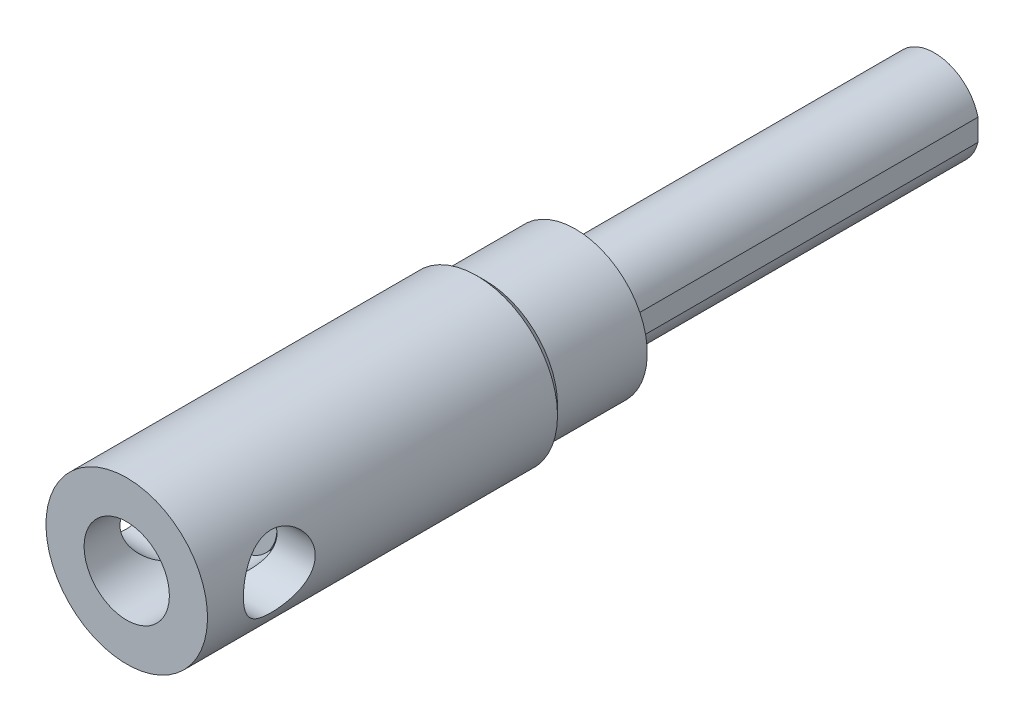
ISO-10303-21;
HEADER;
FILE_DESCRIPTION(('STEP AP214'),'2;1');
FILE_NAME('part.step','',(''),(''),'','','');
FILE_SCHEMA(('AUTOMOTIVE_DESIGN { 1 0 10303 214 1 1 1 1 }'));
ENDSEC;
DATA;
#1=APPLICATION_CONTEXT('core data for automotive mechanical design processes');
#2=APPLICATION_PROTOCOL_DEFINITION('international standard','automotive_design',2000,#1);
#3=PRODUCT_CONTEXT('',#1,'mechanical');
#4=PRODUCT('Part','Part','',(#3));
#5=PRODUCT_RELATED_PRODUCT_CATEGORY('part','',(#4));
#6=PRODUCT_DEFINITION_FORMATION('','',#4);
#7=PRODUCT_DEFINITION_CONTEXT('part definition',#1,'design');
#8=PRODUCT_DEFINITION('design','',#6,#7);
#9=PRODUCT_DEFINITION_SHAPE('','',#8);
#10=(LENGTH_UNIT() NAMED_UNIT(*) SI_UNIT(.MILLI.,.METRE.));
#11=(NAMED_UNIT(*) PLANE_ANGLE_UNIT() SI_UNIT($,.RADIAN.));
#12=(NAMED_UNIT(*) SI_UNIT($,.STERADIAN.) SOLID_ANGLE_UNIT());
#13=UNCERTAINTY_MEASURE_WITH_UNIT(LENGTH_MEASURE(1.E-05),#10,'distance_accuracy_value','');
#14=(GEOMETRIC_REPRESENTATION_CONTEXT(3) GLOBAL_UNCERTAINTY_ASSIGNED_CONTEXT((#13)) GLOBAL_UNIT_ASSIGNED_CONTEXT((#10,
#11,#12)) REPRESENTATION_CONTEXT('',''));
#15=CARTESIAN_POINT('',(0.,0.,0.));
#16=DIRECTION('',(0.,0.,1.));
#17=DIRECTION('',(1.,0.,0.));
#18=AXIS2_PLACEMENT_3D('',#15,#16,#17);
#19=CARTESIAN_POINT('',(2.3094010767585,0.,75.));
#20=DIRECTION('',(-0.866025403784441,0.5,0.));
#21=DIRECTION('',(-0.5,-0.866025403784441,0.));
#22=AXIS2_PLACEMENT_3D('',#19,#20,#21);
#23=PLANE('',#22);
#24=DIRECTION('',(0.,0.,1.));
#25=VECTOR('',#24,1.);
#26=CARTESIAN_POINT('',(1.15470053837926,-2.,75.));
#27=LINE('',#26,#25);
#28=CARTESIAN_POINT('',(1.15470053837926,-2.,75.));
#29=VERTEX_POINT('',#28);
#30=CARTESIAN_POINT('',(1.15470053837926,-2.,77.5));
#31=VERTEX_POINT('',#30);
#32=EDGE_CURVE('E291',#29,#31,#27,.T.);
#33=ORIENTED_EDGE('',*,*,#32,.T.);
#34=DIRECTION('',(-0.5,-0.866025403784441,0.));
#35=VECTOR('',#34,1.);
#36=CARTESIAN_POINT('',(2.3094010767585,0.,77.5));
#37=LINE('',#36,#35);
#38=CARTESIAN_POINT('',(2.3094010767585,0.,77.5));
#39=VERTEX_POINT('',#38);
#40=EDGE_CURVE('E29',#39,#31,#37,.T.);
#41=ORIENTED_EDGE('',*,*,#40,.F.);
#42=DIRECTION('',(0.,0.,1.));
#43=VECTOR('',#42,1.);
#44=CARTESIAN_POINT('',(2.3094010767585,0.,75.));
#45=LINE('',#44,#43);
#46=CARTESIAN_POINT('',(2.3094010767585,0.,75.));
#47=VERTEX_POINT('',#46);
#48=EDGE_CURVE('E33',#47,#39,#45,.T.);
#49=ORIENTED_EDGE('',*,*,#48,.F.);
#50=DIRECTION('',(-0.5,-0.866025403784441,0.));
#51=VECTOR('',#50,1.);
#52=CARTESIAN_POINT('',(2.3094010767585,0.,75.));
#53=LINE('',#52,#51);
#54=EDGE_CURVE('E252',#47,#29,#53,.T.);
#55=ORIENTED_EDGE('',*,*,#54,.T.);
#56=EDGE_LOOP('',(#33,#41,#49,#55));
#57=FACE_BOUND('',#56,.T.);
#58=ADVANCED_FACE('F14',(#57),#23,.T.);
#59=CARTESIAN_POINT('',(-1.15470053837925,-2.,75.));
#60=DIRECTION('',(0.,-1.,0.));
#61=DIRECTION('',(0.,0.,-1.));
#62=AXIS2_PLACEMENT_3D('',#59,#60,#61);
#63=PLANE('',#62);
#64=DIRECTION('',(0.,0.,1.));
#65=VECTOR('',#64,1.);
#66=CARTESIAN_POINT('',(-1.15470053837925,-2.,75.));
#67=LINE('',#66,#65);
#68=CARTESIAN_POINT('',(-1.15470053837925,-2.,75.));
#69=VERTEX_POINT('',#68);
#70=CARTESIAN_POINT('',(-1.15470053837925,-2.,77.5));
#71=VERTEX_POINT('',#70);
#72=EDGE_CURVE('E289',#69,#71,#67,.T.);
#73=ORIENTED_EDGE('',*,*,#72,.T.);
#74=DIRECTION('',(1.,0.,0.));
#75=VECTOR('',#74,1.);
#76=CARTESIAN_POINT('',(-1.15470053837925,-2.,77.5));
#77=LINE('',#76,#75);
#78=EDGE_CURVE('E262',#71,#31,#77,.T.);
#79=ORIENTED_EDGE('',*,*,#78,.T.);
#80=ORIENTED_EDGE('',*,*,#32,.F.);
#81=DIRECTION('',(1.,0.,0.));
#82=VECTOR('',#81,1.);
#83=CARTESIAN_POINT('',(-1.15470053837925,-2.,75.));
#84=LINE('',#83,#82);
#85=EDGE_CURVE('E278',#69,#29,#84,.T.);
#86=ORIENTED_EDGE('',*,*,#85,.F.);
#87=EDGE_LOOP('',(#73,#79,#80,#86));
#88=FACE_BOUND('',#87,.T.);
#89=ADVANCED_FACE('F166',(#88),#63,.F.);
#90=CARTESIAN_POINT('',(-2.3094010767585,0.,75.));
#91=DIRECTION('',(-0.866025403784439,-0.5,0.));
#92=DIRECTION('',(0.5,-0.866025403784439,0.));
#93=AXIS2_PLACEMENT_3D('',#90,#91,#92);
#94=PLANE('',#93);
#95=DIRECTION('',(0.,0.,1.));
#96=VECTOR('',#95,1.);
#97=CARTESIAN_POINT('',(-2.3094010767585,0.,75.));
#98=LINE('',#97,#96);
#99=CARTESIAN_POINT('',(-2.3094010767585,0.,75.));
#100=VERTEX_POINT('',#99);
#101=CARTESIAN_POINT('',(-2.3094010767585,0.,77.5));
#102=VERTEX_POINT('',#101);
#103=EDGE_CURVE('E287',#100,#102,#98,.T.);
#104=ORIENTED_EDGE('',*,*,#103,.T.);
#105=DIRECTION('',(0.5,-0.866025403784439,0.));
#106=VECTOR('',#105,1.);
#107=CARTESIAN_POINT('',(-2.3094010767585,0.,77.5));
#108=LINE('',#107,#106);
#109=EDGE_CURVE('E259',#102,#71,#108,.T.);
#110=ORIENTED_EDGE('',*,*,#109,.T.);
#111=ORIENTED_EDGE('',*,*,#72,.F.);
#112=DIRECTION('',(0.5,-0.866025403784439,0.));
#113=VECTOR('',#112,1.);
#114=CARTESIAN_POINT('',(-2.3094010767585,0.,75.));
#115=LINE('',#114,#113);
#116=EDGE_CURVE('E275',#100,#69,#115,.T.);
#117=ORIENTED_EDGE('',*,*,#116,.F.);
#118=EDGE_LOOP('',(#104,#110,#111,#117));
#119=FACE_BOUND('',#118,.T.);
#120=ADVANCED_FACE('F171',(#119),#94,.F.);
#121=CARTESIAN_POINT('',(-2.3094010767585,0.,75.));
#122=DIRECTION('',(0.866025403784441,-0.5,0.));
#123=DIRECTION('',(0.5,0.866025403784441,0.));
#124=AXIS2_PLACEMENT_3D('',#121,#122,#123);
#125=PLANE('',#124);
#126=DIRECTION('',(0.,0.,1.));
#127=VECTOR('',#126,1.);
#128=CARTESIAN_POINT('',(-1.15470053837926,2.,75.));
#129=LINE('',#128,#127);
#130=CARTESIAN_POINT('',(-1.15470053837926,2.,75.));
#131=VERTEX_POINT('',#130);
#132=CARTESIAN_POINT('',(-1.15470053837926,2.,77.5));
#133=VERTEX_POINT('',#132);
#134=EDGE_CURVE('E285',#131,#133,#129,.T.);
#135=ORIENTED_EDGE('',*,*,#134,.T.);
#136=DIRECTION('',(0.5,0.866025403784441,0.));
#137=VECTOR('',#136,1.);
#138=CARTESIAN_POINT('',(-2.3094010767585,0.,77.5));
#139=LINE('',#138,#137);
#140=EDGE_CURVE('E256',#102,#133,#139,.T.);
#141=ORIENTED_EDGE('',*,*,#140,.F.);
#142=ORIENTED_EDGE('',*,*,#103,.F.);
#143=DIRECTION('',(0.5,0.866025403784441,0.));
#144=VECTOR('',#143,1.);
#145=CARTESIAN_POINT('',(-2.3094010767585,0.,75.));
#146=LINE('',#145,#144);
#147=EDGE_CURVE('E272',#100,#131,#146,.T.);
#148=ORIENTED_EDGE('',*,*,#147,.T.);
#149=EDGE_LOOP('',(#135,#141,#142,#148));
#150=FACE_BOUND('',#149,.T.);
#151=ADVANCED_FACE('F184',(#150),#125,.T.);
#152=CARTESIAN_POINT('',(1.15470053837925,2.,75.));
#153=DIRECTION('',(0.,1.,0.));
#154=DIRECTION('',(-1.,0.,0.));
#155=AXIS2_PLACEMENT_3D('',#152,#153,#154);
#156=PLANE('',#155);
#157=DIRECTION('',(0.,0.,1.));
#158=VECTOR('',#157,1.);
#159=CARTESIAN_POINT('',(1.15470053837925,2.,75.));
#160=LINE('',#159,#158);
#161=CARTESIAN_POINT('',(1.15470053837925,2.,75.));
#162=VERTEX_POINT('',#161);
#163=CARTESIAN_POINT('',(1.15470053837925,2.,77.5));
#164=VERTEX_POINT('',#163);
#165=EDGE_CURVE('E283',#162,#164,#160,.T.);
#166=ORIENTED_EDGE('',*,*,#165,.T.);
#167=DIRECTION('',(-1.,0.,0.));
#168=VECTOR('',#167,1.);
#169=CARTESIAN_POINT('',(1.15470053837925,2.,77.5));
#170=LINE('',#169,#168);
#171=EDGE_CURVE('E253',#164,#133,#170,.T.);
#172=ORIENTED_EDGE('',*,*,#171,.T.);
#173=ORIENTED_EDGE('',*,*,#134,.F.);
#174=DIRECTION('',(-1.,0.,0.));
#175=VECTOR('',#174,1.);
#176=CARTESIAN_POINT('',(1.15470053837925,2.,75.));
#177=LINE('',#176,#175);
#178=EDGE_CURVE('E269',#162,#131,#177,.T.);
#179=ORIENTED_EDGE('',*,*,#178,.F.);
#180=EDGE_LOOP('',(#166,#172,#173,#179));
#181=FACE_BOUND('',#180,.T.);
#182=ADVANCED_FACE('F180',(#181),#156,.F.);
#183=CARTESIAN_POINT('',(2.3094010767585,0.,75.));
#184=DIRECTION('',(0.866025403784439,0.5,0.));
#185=DIRECTION('',(-0.5,0.866025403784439,0.));
#186=AXIS2_PLACEMENT_3D('',#183,#184,#185);
#187=PLANE('',#186);
#188=DIRECTION('',(-0.5,0.866025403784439,0.));
#189=VECTOR('',#188,1.);
#190=CARTESIAN_POINT('',(2.3094010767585,0.,75.));
#191=LINE('',#190,#189);
#192=EDGE_CURVE('E266',#47,#162,#191,.T.);
#193=ORIENTED_EDGE('',*,*,#192,.F.);
#194=ORIENTED_EDGE('',*,*,#48,.T.);
#195=DIRECTION('',(-0.5,0.866025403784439,0.));
#196=VECTOR('',#195,1.);
#197=CARTESIAN_POINT('',(2.3094010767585,0.,77.5));
#198=LINE('',#197,#196);
#199=EDGE_CURVE('E249',#39,#164,#198,.T.);
#200=ORIENTED_EDGE('',*,*,#199,.T.);
#201=ORIENTED_EDGE('',*,*,#165,.F.);
#202=EDGE_LOOP('',(#193,#194,#200,#201));
#203=FACE_BOUND('',#202,.T.);
#204=ADVANCED_FACE('F177',(#203),#187,.F.);
#205=CARTESIAN_POINT('',(3.46410161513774,2.,75.));
#206=DIRECTION('',(0.,0.,-1.));
#207=DIRECTION('',(0.,1.,0.));
#208=AXIS2_PLACEMENT_3D('',#205,#206,#207);
#209=PLANE('',#208);
#210=ORIENTED_EDGE('',*,*,#54,.F.);
#211=ORIENTED_EDGE('',*,*,#192,.T.);
#212=ORIENTED_EDGE('',*,*,#178,.T.);
#213=ORIENTED_EDGE('',*,*,#147,.F.);
#214=ORIENTED_EDGE('',*,*,#116,.T.);
#215=ORIENTED_EDGE('',*,*,#85,.T.);
#216=EDGE_LOOP('',(#210,#211,#212,#213,#214,#215));
#217=FACE_BOUND('',#216,.T.);
#218=ADVANCED_FACE('F176',(#217),#209,.F.);
#219=CARTESIAN_POINT('',(0.,0.,77.5));
#220=DIRECTION('',(0.,0.,1.));
#221=DIRECTION('',(0.,-1.,0.));
#222=AXIS2_PLACEMENT_3D('',#219,#220,#221);
#223=PLANE('',#222);
#224=CARTESIAN_POINT('',(0.,0.,77.5));
#225=DIRECTION('',(0.,0.,1.));
#226=DIRECTION('',(0.,-1.,0.));
#227=AXIS2_PLACEMENT_3D('',#224,#225,#226);
#228=CIRCLE('',#227,4.25);
#229=CARTESIAN_POINT('',(0.,-4.25,77.5));
#230=VERTEX_POINT('',#229);
#231=EDGE_CURVE('E9',#230,#230,#228,.T.);
#232=ORIENTED_EDGE('',*,*,#231,.T.);
#233=EDGE_LOOP('',(#232));
#234=FACE_BOUND('',#233,.T.);
#235=ORIENTED_EDGE('',*,*,#199,.F.);
#236=ORIENTED_EDGE('',*,*,#40,.T.);
#237=ORIENTED_EDGE('',*,*,#78,.F.);
#238=ORIENTED_EDGE('',*,*,#109,.F.);
#239=ORIENTED_EDGE('',*,*,#140,.T.);
#240=ORIENTED_EDGE('',*,*,#171,.F.);
#241=EDGE_LOOP('',(#235,#236,#237,#238,#239,#240));
#242=FACE_BOUND('',#241,.T.);
#243=ADVANCED_FACE('F16',(#234,#242),#223,.T.);
#244=CARTESIAN_POINT('',(0.,0.,72.5));
#245=DIRECTION('',(0.,0.,1.));
#246=DIRECTION('',(0.,-1.,0.));
#247=AXIS2_PLACEMENT_3D('',#244,#245,#246);
#248=CYLINDRICAL_SURFACE('',#247,4.25);
#249=CARTESIAN_POINT('',(0.,0.,72.5));
#250=DIRECTION('',(0.,0.,1.));
#251=DIRECTION('',(0.,-1.,0.));
#252=AXIS2_PLACEMENT_3D('',#249,#250,#251);
#253=CIRCLE('',#252,4.25);
#254=CARTESIAN_POINT('',(0.,-4.25,72.5));
#255=VERTEX_POINT('',#254);
#256=EDGE_CURVE('E22',#255,#255,#253,.T.);
#257=ORIENTED_EDGE('',*,*,#256,.T.);
#258=EDGE_LOOP('',(#257));
#259=FACE_BOUND('',#258,.T.);
#260=ORIENTED_EDGE('',*,*,#231,.F.);
#261=EDGE_LOOP('',(#260));
#262=FACE_BOUND('',#261,.T.);
#263=ADVANCED_FACE('F191',(#259,#262),#248,.T.);
#264=CARTESIAN_POINT('',(0.,0.,0.));
#265=DIRECTION('',(0.,0.,1.));
#266=DIRECTION('',(-1.,0.,0.));
#267=AXIS2_PLACEMENT_3D('',#264,#265,#266);
#268=PLANE('',#267);
#269=DIRECTION('',(0.,-1.,0.));
#270=VECTOR('',#269,1.);
#271=CARTESIAN_POINT('',(4.85,-1.21552457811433,0.));
#272=LINE('',#271,#270);
#273=CARTESIAN_POINT('',(4.85,1.21552457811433,0.));
#274=VERTEX_POINT('',#273);
#275=CARTESIAN_POINT('',(4.85,-1.21552457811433,0.));
#276=VERTEX_POINT('',#275);
#277=EDGE_CURVE('E91',#274,#276,#272,.T.);
#278=ORIENTED_EDGE('',*,*,#277,.T.);
#279=CARTESIAN_POINT('',(0.,0.,0.));
#280=DIRECTION('',(0.,0.,1.));
#281=DIRECTION('',(-1.,0.,0.));
#282=AXIS2_PLACEMENT_3D('',#279,#280,#281);
#283=CIRCLE('',#282,5.);
#284=EDGE_CURVE('E83',#274,#276,#283,.T.);
#285=ORIENTED_EDGE('',*,*,#284,.F.);
#286=EDGE_LOOP('',(#278,#285));
#287=FACE_BOUND('',#286,.T.);
#288=ADVANCED_FACE('F95',(#287),#268,.F.);
#289=CARTESIAN_POINT('',(4.85,-1.21552457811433,60.));
#290=DIRECTION('',(1.,0.,0.));
#291=DIRECTION('',(0.,0.,1.));
#292=AXIS2_PLACEMENT_3D('',#289,#290,#291);
#293=PLANE('',#292);
#294=DIRECTION('',(0.,1.,0.));
#295=VECTOR('',#294,1.);
#296=CARTESIAN_POINT('',(4.85,8.,40.));
#297=LINE('',#296,#295);
#298=CARTESIAN_POINT('',(4.85,-1.21552457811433,40.));
#299=VERTEX_POINT('',#298);
#300=CARTESIAN_POINT('',(4.85,1.21552457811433,40.));
#301=VERTEX_POINT('',#300);
#302=EDGE_CURVE('E246',#299,#301,#297,.T.);
#303=ORIENTED_EDGE('',*,*,#302,.F.);
#304=DIRECTION('',(0.,0.,-1.));
#305=VECTOR('',#304,1.);
#306=CARTESIAN_POINT('',(4.85,-1.21552457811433,60.));
#307=LINE('',#306,#305);
#308=EDGE_CURVE('E88',#299,#276,#307,.T.);
#309=ORIENTED_EDGE('',*,*,#308,.T.);
#310=ORIENTED_EDGE('',*,*,#277,.F.);
#311=DIRECTION('',(0.,0.,-1.));
#312=VECTOR('',#311,1.);
#313=CARTESIAN_POINT('',(4.85,1.21552457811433,60.));
#314=LINE('',#313,#312);
#315=EDGE_CURVE('E78',#301,#274,#314,.T.);
#316=ORIENTED_EDGE('',*,*,#315,.F.);
#317=EDGE_LOOP('',(#303,#309,#310,#316));
#318=FACE_BOUND('',#317,.T.);
#319=ADVANCED_FACE('F92',(#318),#293,.T.);
#320=CARTESIAN_POINT('',(0.,0.,60.));
#321=DIRECTION('',(0.,0.,-1.));
#322=DIRECTION('',(1.,0.,0.));
#323=AXIS2_PLACEMENT_3D('',#320,#321,#322);
#324=CYLINDRICAL_SURFACE('',#323,5.);
#325=ORIENTED_EDGE('',*,*,#308,.F.);
#326=CARTESIAN_POINT('',(0.,0.,40.));
#327=DIRECTION('',(0.,0.,1.));
#328=DIRECTION('',(1.025516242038E-09,-1.,0.));
#329=AXIS2_PLACEMENT_3D('',#326,#327,#328);
#330=CIRCLE('',#329,5.);
#331=EDGE_CURVE('E84',#299,#301,#330,.F.);
#332=ORIENTED_EDGE('',*,*,#331,.T.);
#333=ORIENTED_EDGE('',*,*,#315,.T.);
#334=ORIENTED_EDGE('',*,*,#284,.T.);
#335=EDGE_LOOP('',(#325,#332,#333,#334));
#336=FACE_BOUND('',#335,.T.);
#337=ADVANCED_FACE('F81',(#336),#324,.T.);
#338=CARTESIAN_POINT('',(0.,8.,40.));
#339=DIRECTION('',(0.,0.,1.));
#340=DIRECTION('',(0.,-1.,0.));
#341=AXIS2_PLACEMENT_3D('',#338,#339,#340);
#342=PLANE('',#341);
#343=CARTESIAN_POINT('',(0.,0.,40.));
#344=DIRECTION('',(0.,0.,-1.));
#345=DIRECTION('',(0.,1.,0.));
#346=AXIS2_PLACEMENT_3D('',#343,#344,#345);
#347=CIRCLE('',#346,8.);
#348=CARTESIAN_POINT('',(0.,8.,40.));
#349=VERTEX_POINT('',#348);
#350=EDGE_CURVE('E222',#349,#349,#347,.T.);
#351=ORIENTED_EDGE('',*,*,#350,.T.);
#352=EDGE_LOOP('',(#351));
#353=FACE_BOUND('',#352,.T.);
#354=ORIENTED_EDGE('',*,*,#331,.F.);
#355=ORIENTED_EDGE('',*,*,#302,.T.);
#356=EDGE_LOOP('',(#354,#355));
#357=FACE_BOUND('',#356,.T.);
#358=ADVANCED_FACE('F126',(#353,#357),#342,.F.);
#359=CARTESIAN_POINT('',(0.,0.,40.));
#360=DIRECTION('',(0.,0.,-1.));
#361=DIRECTION('',(0.,1.,0.));
#362=AXIS2_PLACEMENT_3D('',#359,#360,#361);
#363=CYLINDRICAL_SURFACE('',#362,8.);
#364=ORIENTED_EDGE('',*,*,#350,.F.);
#365=EDGE_LOOP('',(#364));
#366=FACE_BOUND('',#365,.T.);
#367=CARTESIAN_POINT('',(0.,0.,50.));
#368=DIRECTION('',(0.,0.,-1.));
#369=DIRECTION('',(0.,1.,0.));
#370=AXIS2_PLACEMENT_3D('',#367,#368,#369);
#371=CIRCLE('',#370,8.);
#372=CARTESIAN_POINT('',(0.,8.,50.));
#373=VERTEX_POINT('',#372);
#374=EDGE_CURVE('E220',#373,#373,#371,.T.);
#375=ORIENTED_EDGE('',*,*,#374,.T.);
#376=EDGE_LOOP('',(#375));
#377=FACE_BOUND('',#376,.T.);
#378=ADVANCED_FACE('F151',(#366,#377),#363,.T.);
#379=CARTESIAN_POINT('',(0.,0.,50.));
#380=DIRECTION('',(0.,0.,1.));
#381=DIRECTION('',(0.,-1.,0.));
#382=AXIS2_PLACEMENT_3D('',#379,#380,#381);
#383=CONICAL_SURFACE('',#382,8.,0.785398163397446);
#384=CARTESIAN_POINT('',(0.,0.,51.));
#385=DIRECTION('',(0.,0.,1.));
#386=DIRECTION('',(0.,-1.,0.));
#387=AXIS2_PLACEMENT_3D('',#384,#385,#386);
#388=CIRCLE('',#387,9.);
#389=CARTESIAN_POINT('',(0.,-9.,51.));
#390=VERTEX_POINT('',#389);
#391=EDGE_CURVE('E145',#390,#390,#388,.T.);
#392=ORIENTED_EDGE('',*,*,#391,.F.);
#393=EDGE_LOOP('',(#392));
#394=FACE_BOUND('',#393,.T.);
#395=ORIENTED_EDGE('',*,*,#374,.F.);
#396=EDGE_LOOP('',(#395));
#397=FACE_BOUND('',#396,.T.);
#398=ADVANCED_FACE('F124',(#394,#397),#383,.T.);
#399=CARTESIAN_POINT('',(0.,0.,40.));
#400=DIRECTION('',(0.,0.,-1.));
#401=DIRECTION('',(0.,1.,0.));
#402=AXIS2_PLACEMENT_3D('',#399,#400,#401);
#403=CYLINDRICAL_SURFACE('',#402,9.);
#404=ORIENTED_EDGE('',*,*,#391,.T.);
#405=EDGE_LOOP('',(#404));
#406=FACE_BOUND('',#405,.T.);
#407=CARTESIAN_POINT('',(-9.,0.,86.));
#408=CARTESIAN_POINT('',(-8.99999931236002,-0.106543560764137,85.9999991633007));
#409=CARTESIAN_POINT('',(-8.99810295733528,-0.213114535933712,85.995737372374));
#410=CARTESIAN_POINT('',(-8.99056534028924,-0.425487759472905,85.9787335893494));
#411=CARTESIAN_POINT('',(-8.9849219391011,-0.531289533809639,85.9659867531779));
#412=CARTESIAN_POINT('',(-8.97002203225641,-0.741497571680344,85.9321151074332));
#413=CARTESIAN_POINT('',(-8.96075877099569,-0.845900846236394,85.9109746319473));
#414=CARTESIAN_POINT('',(-8.93886560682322,-1.05237393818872,85.8605472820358));
#415=CARTESIAN_POINT('',(-8.9262343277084,-1.15444278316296,85.8312570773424));
#416=CARTESIAN_POINT('',(-8.88385509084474,-1.45528706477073,85.7318268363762));
#417=CARTESIAN_POINT('',(-8.84954694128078,-1.64969223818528,85.6499645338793));
#418=CARTESIAN_POINT('',(-8.7720569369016,-2.02169397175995,85.457842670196));
#419=CARTESIAN_POINT('',(-8.7288771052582,-2.19929435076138,85.3475895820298));
#420=CARTESIAN_POINT('',(-8.63520005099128,-2.5429519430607,85.0953295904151));
#421=CARTESIAN_POINT('',(-8.5844425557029,-2.70796463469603,84.951994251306));
#422=CARTESIAN_POINT('',(-8.48237167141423,-3.0125119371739,84.6405139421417));
#423=CARTESIAN_POINT('',(-8.43105797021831,-3.15203136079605,84.4723542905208));
#424=CARTESIAN_POINT('',(-8.33031613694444,-3.40970641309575,84.1040790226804));
#425=CARTESIAN_POINT('',(-8.28116793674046,-3.52616342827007,83.9026789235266));
#426=CARTESIAN_POINT('',(-8.21620901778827,-3.67379855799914,83.5864416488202));
#427=CARTESIAN_POINT('',(-8.19601074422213,-3.71851343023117,83.4786304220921));
#428=CARTESIAN_POINT('',(-8.15924882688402,-3.79849956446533,83.2589808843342));
#429=CARTESIAN_POINT('',(-8.14268322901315,-3.83377590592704,83.1471447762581));
#430=CARTESIAN_POINT('',(-8.11458487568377,-3.89288163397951,82.9262099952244));
#431=CARTESIAN_POINT('',(-8.10283476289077,-3.91721191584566,82.8172725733));
#432=CARTESIAN_POINT('',(-8.08362129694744,-3.95670961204,82.5974216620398));
#433=CARTESIAN_POINT('',(-8.07615587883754,-3.97188144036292,82.4865091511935));
#434=CARTESIAN_POINT('',(-8.06579894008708,-3.99287182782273,82.2636277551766));
#435=CARTESIAN_POINT('',(-8.06290582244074,-3.99869365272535,82.1516592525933));
#436=CARTESIAN_POINT('',(-8.06180452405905,-4.0009136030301,81.9276108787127));
#437=CARTESIAN_POINT('',(-8.06359604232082,-3.9973123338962,81.8155310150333));
#438=CARTESIAN_POINT('',(-8.0714233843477,-3.98148137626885,81.6022728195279));
#439=CARTESIAN_POINT('',(-8.07706352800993,-3.97005575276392,81.5010195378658));
#440=CARTESIAN_POINT('',(-8.09197245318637,-3.93957606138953,81.2999289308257));
#441=CARTESIAN_POINT('',(-8.10124240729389,-3.92051952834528,81.2000920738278));
#442=CARTESIAN_POINT('',(-8.13408651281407,-3.85217674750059,80.9037623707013));
#443=CARTESIAN_POINT('',(-8.16270181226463,-3.79170447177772,80.7102821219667));
#444=CARTESIAN_POINT('',(-8.23081734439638,-3.64150006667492,80.332101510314));
#445=CARTESIAN_POINT('',(-8.27054749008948,-3.55114161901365,80.1476957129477));
#446=CARTESIAN_POINT('',(-8.35638151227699,-3.3441634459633,79.7958565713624));
#447=CARTESIAN_POINT('',(-8.40248806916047,-3.22753266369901,79.6284304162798));
#448=CARTESIAN_POINT('',(-8.50133279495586,-2.95801583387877,79.2981702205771));
#449=CARTESIAN_POINT('',(-8.5542794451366,-2.80270476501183,79.1373723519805));
#450=CARTESIAN_POINT('',(-8.65709798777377,-2.46687651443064,78.8433658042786));
#451=CARTESIAN_POINT('',(-8.70696894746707,-2.28635173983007,78.7101654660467));
#452=CARTESIAN_POINT('',(-8.79984898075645,-1.89830549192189,78.4715733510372));
#453=CARTESIAN_POINT('',(-8.84261183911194,-1.69014406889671,78.3671192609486));
#454=CARTESIAN_POINT('',(-8.91451161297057,-1.2568148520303,78.1954461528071));
#455=CARTESIAN_POINT('',(-8.94365711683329,-1.03165788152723,78.1282036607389));
#456=CARTESIAN_POINT('',(-8.98336516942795,-0.587641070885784,78.0373762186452));
#457=CARTESIAN_POINT('',(-8.99508492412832,-0.369442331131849,78.0110665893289));
#458=CARTESIAN_POINT('',(-9.00240007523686,0.0685540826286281,77.994593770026));
#459=CARTESIAN_POINT('',(-8.99800094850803,0.288351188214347,78.0044183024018));
#460=CARTESIAN_POINT('',(-8.97430591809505,0.709814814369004,78.0580870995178));
#461=CARTESIAN_POINT('',(-8.95589038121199,0.91179276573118,78.0999216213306));
#462=CARTESIAN_POINT('',(-8.90701082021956,1.30558421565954,78.2135161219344));
#463=CARTESIAN_POINT('',(-8.87654533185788,1.49739647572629,78.2852797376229));
#464=CARTESIAN_POINT('',(-8.80524764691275,1.8722078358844,78.4589771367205));
#465=CARTESIAN_POINT('',(-8.76412168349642,2.05474529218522,78.5617823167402));
#466=CARTESIAN_POINT('',(-8.67576208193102,2.40063957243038,78.7937052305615));
#467=CARTESIAN_POINT('',(-8.62852578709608,2.56398799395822,78.9228344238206));
#468=CARTESIAN_POINT('',(-8.52825739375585,2.88073032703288,79.2158239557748));
#469=CARTESIAN_POINT('',(-8.47506500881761,3.0322609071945,79.3816446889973));
#470=CARTESIAN_POINT('',(-8.37207677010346,3.30602071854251,79.7371478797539));
#471=CARTESIAN_POINT('',(-8.32228212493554,3.42823956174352,79.9268387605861));
#472=CARTESIAN_POINT('',(-8.25404075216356,3.58807434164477,80.2282454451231));
#473=CARTESIAN_POINT('',(-8.23214803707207,3.63788387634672,80.3328797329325));
#474=CARTESIAN_POINT('',(-8.19154569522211,3.72840991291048,80.5465889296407));
#475=CARTESIAN_POINT('',(-8.17283464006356,3.76913049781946,80.6556618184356));
#476=CARTESIAN_POINT('',(-8.13929816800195,3.84101557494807,80.8774217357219));
#477=CARTESIAN_POINT('',(-8.12447050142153,3.8721856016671,80.9901066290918));
#478=CARTESIAN_POINT('',(-8.09927719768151,3.92460929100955,81.2182490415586));
#479=CARTESIAN_POINT('',(-8.08891105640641,3.94586407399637,81.3337062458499));
#480=CARTESIAN_POINT('',(-8.07374935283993,3.97678770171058,81.5564793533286));
#481=CARTESIAN_POINT('',(-8.06855529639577,3.98728755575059,81.6636534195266));
#482=CARTESIAN_POINT('',(-8.06245450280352,3.99960939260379,81.8786598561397));
#483=CARTESIAN_POINT('',(-8.06154919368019,4.00142848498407,81.9864924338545));
#484=CARTESIAN_POINT('',(-8.06406616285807,3.99635429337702,82.2018440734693));
#485=CARTESIAN_POINT('',(-8.06748593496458,3.98946605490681,82.3093632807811));
#486=CARTESIAN_POINT('',(-8.07851431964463,3.96708318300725,82.5232976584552));
#487=CARTESIAN_POINT('',(-8.08612450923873,3.95158530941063,82.6297123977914));
#488=CARTESIAN_POINT('',(-8.11370655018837,3.89481025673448,82.9332533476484));
#489=CARTESIAN_POINT('',(-8.13866591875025,3.8428451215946,83.1280439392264));
#490=CARTESIAN_POINT('',(-8.19957700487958,3.71108221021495,83.5059989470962));
#491=CARTESIAN_POINT('',(-8.23553189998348,3.6312763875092,83.6891599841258));
#492=CARTESIAN_POINT('',(-8.31722161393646,3.44024324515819,84.051664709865));
#493=CARTESIAN_POINT('',(-8.36343549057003,3.32733013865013,84.2300116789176));
#494=CARTESIAN_POINT('',(-8.45929191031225,3.07546946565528,84.5662532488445));
#495=CARTESIAN_POINT('',(-8.50893588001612,2.93651102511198,84.7241392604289));
#496=CARTESIAN_POINT('',(-8.61126362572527,2.62217220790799,85.0292405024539));
#497=CARTESIAN_POINT('',(-8.66383343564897,2.44466910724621,85.1743141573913));
#498=CARTESIAN_POINT('',(-8.76186799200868,2.0658662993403,85.4328842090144));
#499=CARTESIAN_POINT('',(-8.80732948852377,1.86455578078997,85.5463661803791));
#500=CARTESIAN_POINT('',(-8.86614466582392,1.55009155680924,85.6892195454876));
#501=CARTESIAN_POINT('',(-8.88411858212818,1.44376115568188,85.732125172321));
#502=CARTESIAN_POINT('',(-8.91658812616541,1.22735110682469,85.8087739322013));
#503=CARTESIAN_POINT('',(-8.93108542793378,1.11727329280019,85.8425214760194));
#504=CARTESIAN_POINT('',(-8.95614098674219,0.894475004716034,85.9004023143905));
#505=CARTESIAN_POINT('',(-8.96670865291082,0.781761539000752,85.9245585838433));
#506=CARTESIAN_POINT('',(-8.98362931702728,0.554414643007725,85.9630667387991));
#507=CARTESIAN_POINT('',(-8.98998524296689,0.439782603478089,85.9774254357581));
#508=CARTESIAN_POINT('',(-8.99608997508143,0.270722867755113,85.99119614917));
#509=CARTESIAN_POINT('',(-8.99755504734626,0.216644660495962,85.994496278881));
#510=CARTESIAN_POINT('',(-8.99951024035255,0.108380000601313,85.9988984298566));
#511=CARTESIAN_POINT('',(-9.00000034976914,0.0541935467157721,86.0000004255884));
#512=CARTESIAN_POINT('',(-9.,0.,86.));
#513=B_SPLINE_CURVE_WITH_KNOTS('',3,(#407,#408,#409,#410,#411,#412,#413,#414,#415,#416,#417,
#418,#419,#420,#421,#422,#423,#424,#425,#426,#427,#428,#429,#430,#431,#432,#433,#434,#435,#436,
#437,#438,#439,#440,#441,#442,#443,#444,#445,#446,#447,#448,#449,#450,#451,#452,#453,#454,#455,
#456,#457,#458,#459,#460,#461,#462,#463,#464,#465,#466,#467,#468,#469,#470,#471,#472,#473,#474,
#475,#476,#477,#478,#479,#480,#481,#482,#483,#484,#485,#486,#487,#488,#489,#490,#491,#492,#493,
#494,#495,#496,#497,#498,#499,#500,#501,#502,#503,#504,#505,#506,#507,#508,#509,#510,#511,#512),
.UNSPECIFIED.,.T.,.F.,(4,2,2,2,2,2,2,2,2,2,2,2,2,2,2,2,2,2,2,2,2,2,2,2,2,2,2,2,2,2,2,2,2,2,2,2,
2,2,2,2,2,2,2,2,2,2,2,2,2,2,2,2,4),(0.,0.319575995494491,0.63933459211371,0.959692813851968,
1.28018213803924,1.91817504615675,2.55602262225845,3.22626867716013,3.89691272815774,
4.60627839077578,4.96122462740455,5.3159794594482,5.65223953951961,5.98833742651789,
6.32431789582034,6.66027677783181,6.96605959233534,7.27194127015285,7.88320420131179,
8.50818797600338,9.13343527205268,9.81959120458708,10.5059542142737,11.2125921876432,
11.9187838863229,12.5755805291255,13.2321540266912,13.8505799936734,14.4690811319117,
15.1068781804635,15.7449534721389,16.4344546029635,17.1241997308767,17.4776093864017,
17.8308599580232,18.1839054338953,18.5369110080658,18.8599212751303,19.1830390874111,
19.5059697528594,19.8290220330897,20.4355356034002,21.042224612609,21.6877902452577,
22.3336260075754,23.0359566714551,23.7386075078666,24.0863996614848,24.4340240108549,
24.7808105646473,25.1273557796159,25.2899067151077,25.4524595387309),.UNSPECIFIED.);
#514=CARTESIAN_POINT('',(-9.,0.,86.));
#515=VERTEX_POINT('',#514);
#516=EDGE_CURVE('E139',#515,#515,#513,.T.);
#517=ORIENTED_EDGE('',*,*,#516,.T.);
#518=EDGE_LOOP('',(#517));
#519=FACE_BOUND('',#518,.T.);
#520=CARTESIAN_POINT('',(9.,0.,86.));
#521=CARTESIAN_POINT('',(8.99999931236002,0.106543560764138,85.9999991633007));
#522=CARTESIAN_POINT('',(8.99810295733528,0.213114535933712,85.995737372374));
#523=CARTESIAN_POINT('',(8.99056534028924,0.425487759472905,85.9787335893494));
#524=CARTESIAN_POINT('',(8.9849219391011,0.531289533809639,85.9659867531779));
#525=CARTESIAN_POINT('',(8.97002203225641,0.741497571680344,85.9321151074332));
#526=CARTESIAN_POINT('',(8.96075877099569,0.845900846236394,85.9109746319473));
#527=CARTESIAN_POINT('',(8.93886560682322,1.05237393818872,85.8605472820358));
#528=CARTESIAN_POINT('',(8.9262343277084,1.15444278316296,85.8312570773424));
#529=CARTESIAN_POINT('',(8.88385509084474,1.45528706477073,85.7318268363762));
#530=CARTESIAN_POINT('',(8.84954694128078,1.64969223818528,85.6499645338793));
#531=CARTESIAN_POINT('',(8.7720569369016,2.02169397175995,85.457842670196));
#532=CARTESIAN_POINT('',(8.7288771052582,2.19929435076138,85.3475895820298));
#533=CARTESIAN_POINT('',(8.63520005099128,2.5429519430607,85.0953295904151));
#534=CARTESIAN_POINT('',(8.5844425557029,2.70796463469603,84.951994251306));
#535=CARTESIAN_POINT('',(8.48237167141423,3.0125119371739,84.6405139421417));
#536=CARTESIAN_POINT('',(8.43105797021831,3.15203136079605,84.4723542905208));
#537=CARTESIAN_POINT('',(8.33031613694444,3.40970641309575,84.1040790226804));
#538=CARTESIAN_POINT('',(8.28116793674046,3.52616342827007,83.9026789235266));
#539=CARTESIAN_POINT('',(8.21620901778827,3.67379855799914,83.5864416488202));
#540=CARTESIAN_POINT('',(8.19601074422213,3.71851343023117,83.4786304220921));
#541=CARTESIAN_POINT('',(8.15924882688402,3.79849956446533,83.2589808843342));
#542=CARTESIAN_POINT('',(8.14268322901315,3.83377590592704,83.1471447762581));
#543=CARTESIAN_POINT('',(8.11458487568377,3.89288163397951,82.9262099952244));
#544=CARTESIAN_POINT('',(8.10283476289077,3.91721191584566,82.8172725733));
#545=CARTESIAN_POINT('',(8.08362129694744,3.95670961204,82.5974216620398));
#546=CARTESIAN_POINT('',(8.07615587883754,3.97188144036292,82.4865091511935));
#547=CARTESIAN_POINT('',(8.06579894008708,3.99287182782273,82.2636277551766));
#548=CARTESIAN_POINT('',(8.06290582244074,3.99869365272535,82.1516592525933));
#549=CARTESIAN_POINT('',(8.06180452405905,4.0009136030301,81.9276108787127));
#550=CARTESIAN_POINT('',(8.06359604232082,3.9973123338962,81.8155310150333));
#551=CARTESIAN_POINT('',(8.0714233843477,3.98148137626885,81.6022728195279));
#552=CARTESIAN_POINT('',(8.07706352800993,3.97005575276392,81.5010195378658));
#553=CARTESIAN_POINT('',(8.09197245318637,3.93957606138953,81.2999289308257));
#554=CARTESIAN_POINT('',(8.10124240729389,3.92051952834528,81.2000920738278));
#555=CARTESIAN_POINT('',(8.13408651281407,3.85217674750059,80.9037623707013));
#556=CARTESIAN_POINT('',(8.16270181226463,3.79170447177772,80.7102821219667));
#557=CARTESIAN_POINT('',(8.23081734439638,3.64150006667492,80.332101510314));
#558=CARTESIAN_POINT('',(8.27054749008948,3.55114161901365,80.1476957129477));
#559=CARTESIAN_POINT('',(8.35638151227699,3.3441634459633,79.7958565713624));
#560=CARTESIAN_POINT('',(8.40248806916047,3.22753266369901,79.6284304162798));
#561=CARTESIAN_POINT('',(8.50133279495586,2.95801583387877,79.2981702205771));
#562=CARTESIAN_POINT('',(8.5542794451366,2.80270476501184,79.1373723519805));
#563=CARTESIAN_POINT('',(8.65709798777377,2.46687651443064,78.8433658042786));
#564=CARTESIAN_POINT('',(8.70696894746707,2.28635173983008,78.7101654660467));
#565=CARTESIAN_POINT('',(8.79984898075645,1.8983054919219,78.4715733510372));
#566=CARTESIAN_POINT('',(8.84261183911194,1.69014406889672,78.3671192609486));
#567=CARTESIAN_POINT('',(8.91451161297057,1.2568148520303,78.1954461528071));
#568=CARTESIAN_POINT('',(8.94365711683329,1.03165788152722,78.1282036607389));
#569=CARTESIAN_POINT('',(8.98336516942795,0.587641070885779,78.0373762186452));
#570=CARTESIAN_POINT('',(8.99508492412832,0.369442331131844,78.0110665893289));
#571=CARTESIAN_POINT('',(9.00240007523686,-0.0685540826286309,77.994593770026));
#572=CARTESIAN_POINT('',(8.99800094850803,-0.288351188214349,78.0044183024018));
#573=CARTESIAN_POINT('',(8.97430591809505,-0.709814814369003,78.0580870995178));
#574=CARTESIAN_POINT('',(8.95589038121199,-0.911792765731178,78.0999216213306));
#575=CARTESIAN_POINT('',(8.90701082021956,-1.30558421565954,78.2135161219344));
#576=CARTESIAN_POINT('',(8.87654533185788,-1.49739647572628,78.2852797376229));
#577=CARTESIAN_POINT('',(8.80524764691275,-1.8722078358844,78.4589771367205));
#578=CARTESIAN_POINT('',(8.76412168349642,-2.05474529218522,78.5617823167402));
#579=CARTESIAN_POINT('',(8.67576208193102,-2.40063957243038,78.7937052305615));
#580=CARTESIAN_POINT('',(8.62852578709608,-2.56398799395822,78.9228344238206));
#581=CARTESIAN_POINT('',(8.52825739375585,-2.88073032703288,79.2158239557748));
#582=CARTESIAN_POINT('',(8.47506500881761,-3.0322609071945,79.3816446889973));
#583=CARTESIAN_POINT('',(8.37207677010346,-3.30602071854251,79.7371478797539));
#584=CARTESIAN_POINT('',(8.32228212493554,-3.42823956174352,79.9268387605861));
#585=CARTESIAN_POINT('',(8.25404075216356,-3.58807434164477,80.2282454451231));
#586=CARTESIAN_POINT('',(8.23214803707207,-3.63788387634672,80.3328797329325));
#587=CARTESIAN_POINT('',(8.19154569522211,-3.72840991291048,80.5465889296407));
#588=CARTESIAN_POINT('',(8.17283464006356,-3.76913049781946,80.6556618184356));
#589=CARTESIAN_POINT('',(8.13929816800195,-3.84101557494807,80.8774217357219));
#590=CARTESIAN_POINT('',(8.12447050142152,-3.8721856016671,80.9901066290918));
#591=CARTESIAN_POINT('',(8.0992771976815,-3.92460929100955,81.2182490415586));
#592=CARTESIAN_POINT('',(8.08891105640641,-3.94586407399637,81.3337062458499));
#593=CARTESIAN_POINT('',(8.07374935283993,-3.97678770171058,81.5564793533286));
#594=CARTESIAN_POINT('',(8.06855529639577,-3.98728755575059,81.6636534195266));
#595=CARTESIAN_POINT('',(8.06245450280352,-3.99960939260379,81.8786598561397));
#596=CARTESIAN_POINT('',(8.06154919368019,-4.00142848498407,81.9864924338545));
#597=CARTESIAN_POINT('',(8.06406616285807,-3.99635429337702,82.2018440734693));
#598=CARTESIAN_POINT('',(8.06748593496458,-3.98946605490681,82.3093632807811));
#599=CARTESIAN_POINT('',(8.07851431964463,-3.96708318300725,82.5232976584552));
#600=CARTESIAN_POINT('',(8.08612450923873,-3.95158530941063,82.6297123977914));
#601=CARTESIAN_POINT('',(8.11370655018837,-3.89481025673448,82.9332533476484));
#602=CARTESIAN_POINT('',(8.13866591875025,-3.8428451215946,83.1280439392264));
#603=CARTESIAN_POINT('',(8.19957700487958,-3.71108221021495,83.5059989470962));
#604=CARTESIAN_POINT('',(8.23553189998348,-3.6312763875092,83.6891599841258));
#605=CARTESIAN_POINT('',(8.31722161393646,-3.44024324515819,84.051664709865));
#606=CARTESIAN_POINT('',(8.36343549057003,-3.32733013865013,84.2300116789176));
#607=CARTESIAN_POINT('',(8.45929191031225,-3.07546946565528,84.5662532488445));
#608=CARTESIAN_POINT('',(8.50893588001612,-2.93651102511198,84.7241392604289));
#609=CARTESIAN_POINT('',(8.61126362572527,-2.62217220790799,85.0292405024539));
#610=CARTESIAN_POINT('',(8.66383343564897,-2.44466910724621,85.1743141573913));
#611=CARTESIAN_POINT('',(8.76186799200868,-2.0658662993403,85.4328842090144));
#612=CARTESIAN_POINT('',(8.80732948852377,-1.86455578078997,85.5463661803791));
#613=CARTESIAN_POINT('',(8.86614466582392,-1.55009155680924,85.6892195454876));
#614=CARTESIAN_POINT('',(8.88411858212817,-1.44376115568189,85.732125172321));
#615=CARTESIAN_POINT('',(8.91658812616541,-1.2273511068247,85.8087739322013));
#616=CARTESIAN_POINT('',(8.93108542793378,-1.1172732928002,85.8425214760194));
#617=CARTESIAN_POINT('',(8.9561409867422,-0.894475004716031,85.9004023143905));
#618=CARTESIAN_POINT('',(8.96670865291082,-0.781761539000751,85.9245585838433));
#619=CARTESIAN_POINT('',(8.98362931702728,-0.554414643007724,85.9630667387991));
#620=CARTESIAN_POINT('',(8.98998524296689,-0.439782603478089,85.9774254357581));
#621=CARTESIAN_POINT('',(8.99608997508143,-0.270722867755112,85.99119614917));
#622=CARTESIAN_POINT('',(8.99755504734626,-0.216644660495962,85.994496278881));
#623=CARTESIAN_POINT('',(8.99951024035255,-0.108380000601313,85.9988984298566));
#624=CARTESIAN_POINT('',(9.00000034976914,-0.0541935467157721,86.0000004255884));
#625=CARTESIAN_POINT('',(9.,0.,86.));
#626=B_SPLINE_CURVE_WITH_KNOTS('',3,(#520,#521,#522,#523,#524,#525,#526,#527,#528,#529,#530,
#531,#532,#533,#534,#535,#536,#537,#538,#539,#540,#541,#542,#543,#544,#545,#546,#547,#548,#549,
#550,#551,#552,#553,#554,#555,#556,#557,#558,#559,#560,#561,#562,#563,#564,#565,#566,#567,#568,
#569,#570,#571,#572,#573,#574,#575,#576,#577,#578,#579,#580,#581,#582,#583,#584,#585,#586,#587,
#588,#589,#590,#591,#592,#593,#594,#595,#596,#597,#598,#599,#600,#601,#602,#603,#604,#605,#606,
#607,#608,#609,#610,#611,#612,#613,#614,#615,#616,#617,#618,#619,#620,#621,#622,#623,#624,#625),
.UNSPECIFIED.,.T.,.F.,(4,2,2,2,2,2,2,2,2,2,2,2,2,2,2,2,2,2,2,2,2,2,2,2,2,2,2,2,2,2,2,2,2,2,2,2,
2,2,2,2,2,2,2,2,2,2,2,2,2,2,2,2,4),(0.,0.319575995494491,0.63933459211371,0.959692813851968,
1.28018213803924,1.91817504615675,2.55602262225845,3.22626867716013,3.89691272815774,
4.60627839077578,4.96122462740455,5.3159794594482,5.65223953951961,5.98833742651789,
6.32431789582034,6.66027677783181,6.96605959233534,7.27194127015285,7.88320420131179,
8.50818797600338,9.13343527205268,9.81959120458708,10.5059542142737,11.2125921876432,
11.9187838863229,12.5755805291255,13.2321540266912,13.8505799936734,14.4690811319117,
15.1068781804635,15.7449534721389,16.4344546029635,17.1241997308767,17.4776093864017,
17.8308599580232,18.1839054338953,18.5369110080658,18.8599212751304,19.1830390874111,
19.5059697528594,19.8290220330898,20.4355356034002,21.042224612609,21.6877902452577,
22.3336260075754,23.0359566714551,23.7386075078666,24.0863996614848,24.4340240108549,
24.7808105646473,25.1273557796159,25.2899067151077,25.452459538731),.UNSPECIFIED.);
#627=CARTESIAN_POINT('',(9.,0.,86.));
#628=VERTEX_POINT('',#627);
#629=EDGE_CURVE('E131',#628,#628,#626,.T.);
#630=ORIENTED_EDGE('',*,*,#629,.T.);
#631=EDGE_LOOP('',(#630));
#632=FACE_BOUND('',#631,.T.);
#633=CARTESIAN_POINT('',(0.,0.,90.));
#634=DIRECTION('',(0.,0.,-1.));
#635=DIRECTION('',(0.,1.,0.));
#636=AXIS2_PLACEMENT_3D('',#633,#634,#635);
#637=CIRCLE('',#636,9.);
#638=CARTESIAN_POINT('',(0.,9.,90.));
#639=VERTEX_POINT('',#638);
#640=EDGE_CURVE('E215',#639,#639,#637,.T.);
#641=ORIENTED_EDGE('',*,*,#640,.T.);
#642=EDGE_LOOP('',(#641));
#643=FACE_BOUND('',#642,.T.);
#644=ADVANCED_FACE('F123',(#406,#519,#632,#643),#403,.T.);
#645=CARTESIAN_POINT('',(0.,9.,90.));
#646=DIRECTION('',(0.,0.,-1.));
#647=DIRECTION('',(0.,1.,0.));
#648=AXIS2_PLACEMENT_3D('',#645,#646,#647);
#649=PLANE('',#648);
#650=ORIENTED_EDGE('',*,*,#640,.F.);
#651=EDGE_LOOP('',(#650));
#652=FACE_BOUND('',#651,.T.);
#653=CARTESIAN_POINT('',(0.,0.,90.));
#654=DIRECTION('',(0.,0.,-1.));
#655=DIRECTION('',(0.,1.,0.));
#656=AXIS2_PLACEMENT_3D('',#653,#654,#655);
#657=CIRCLE('',#656,4.75);
#658=CARTESIAN_POINT('',(0.,4.75,90.));
#659=VERTEX_POINT('',#658);
#660=EDGE_CURVE('E212',#659,#659,#657,.T.);
#661=ORIENTED_EDGE('',*,*,#660,.T.);
#662=EDGE_LOOP('',(#661));
#663=FACE_BOUND('',#662,.T.);
#664=ADVANCED_FACE('F149',(#652,#663),#649,.F.);
#665=CARTESIAN_POINT('',(-9.,0.,82.));
#666=DIRECTION('',(1.,0.,0.));
#667=DIRECTION('',(0.,0.,1.));
#668=AXIS2_PLACEMENT_3D('',#665,#666,#667);
#669=CYLINDRICAL_SURFACE('',#668,4.);
#670=ORIENTED_EDGE('',*,*,#629,.F.);
#671=EDGE_LOOP('',(#670));
#672=FACE_BOUND('',#671,.T.);
#673=CARTESIAN_POINT('',(4.75,0.,86.));
#674=CARTESIAN_POINT('',(4.74999936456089,-0.094630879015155,85.9999993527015));
#675=CARTESIAN_POINT('',(4.74716576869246,-0.189272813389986,85.9966356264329));
#676=CARTESIAN_POINT('',(4.73589516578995,-0.377785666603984,85.9832418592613));
#677=CARTESIAN_POINT('',(4.72745532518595,-0.471656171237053,85.9732084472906));
#678=CARTESIAN_POINT('',(4.70514486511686,-0.657969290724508,85.946636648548));
#679=CARTESIAN_POINT('',(4.69126581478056,-0.750409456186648,85.9300881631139));
#680=CARTESIAN_POINT('',(4.65838527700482,-0.9330466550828,85.8907797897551));
#681=CARTESIAN_POINT('',(4.6393814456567,-1.02324264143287,85.8680170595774));
#682=CARTESIAN_POINT('',(4.57554341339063,-1.2882861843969,85.7912944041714));
#683=CARTESIAN_POINT('',(4.52369971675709,-1.45904180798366,85.7286848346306));
#684=CARTESIAN_POINT('',(4.40489158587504,-1.78599399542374,85.5836159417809));
#685=CARTESIAN_POINT('',(4.33792635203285,-1.94218978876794,85.5011555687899));
#686=CARTESIAN_POINT('',(4.2154572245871,-2.19209257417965,85.3479808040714));
#687=CARTESIAN_POINT('',(4.16293584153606,-2.29004532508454,85.2816807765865));
#688=CARTESIAN_POINT('',(4.05371419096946,-2.478252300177,85.1419737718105));
#689=CARTESIAN_POINT('',(3.9970138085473,-2.56850631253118,85.0685665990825));
#690=CARTESIAN_POINT('',(3.88043272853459,-2.74146884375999,84.915091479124));
#691=CARTESIAN_POINT('',(3.82054355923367,-2.82415549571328,84.835005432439));
#692=CARTESIAN_POINT('',(3.69891610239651,-2.98168005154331,84.6688362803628));
#693=CARTESIAN_POINT('',(3.63717848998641,-3.05652077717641,84.5827553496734));
#694=CARTESIAN_POINT('',(3.51187137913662,-3.19976319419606,84.4031162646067));
#695=CARTESIAN_POINT('',(3.44828946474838,-3.26801371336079,84.3094463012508));
#696=CARTESIAN_POINT('',(3.32191736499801,-3.3963916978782,84.1161271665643));
#697=CARTESIAN_POINT('',(3.25912745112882,-3.45651644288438,84.0164760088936));
#698=CARTESIAN_POINT('',(3.13631382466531,-3.56832027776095,83.8112738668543));
#699=CARTESIAN_POINT('',(3.07628410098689,-3.62001841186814,83.7057369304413));
#700=CARTESIAN_POINT('',(2.96125068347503,-3.71470542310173,83.4882928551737));
#701=CARTESIAN_POINT('',(2.90624278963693,-3.75770161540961,83.3763911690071));
#702=CARTESIAN_POINT('',(2.80031734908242,-3.83737548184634,83.1365546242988));
#703=CARTESIAN_POINT('',(2.75007336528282,-3.87327835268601,83.0080524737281));
#704=CARTESIAN_POINT('',(2.66453766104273,-3.93261604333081,82.7435219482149));
#705=CARTESIAN_POINT('',(2.62921109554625,-3.9560799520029,82.6075119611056));
#706=CARTESIAN_POINT('',(2.57896801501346,-3.98903630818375,82.3279711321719));
#707=CARTESIAN_POINT('',(2.56432695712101,-3.99834031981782,82.1843647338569));
#708=CARTESIAN_POINT('',(2.55978851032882,-4.00124971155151,81.8966250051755));
#709=CARTESIAN_POINT('',(2.56988271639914,-3.99486042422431,81.7524918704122));
#710=CARTESIAN_POINT('',(2.61361012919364,-3.96638298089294,81.460944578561));
#711=CARTESIAN_POINT('',(2.64859148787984,-3.94339451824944,81.313835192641));
#712=CARTESIAN_POINT('',(2.73652012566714,-3.88287998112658,81.0280248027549));
#713=CARTESIAN_POINT('',(2.78952886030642,-3.8453041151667,80.8893544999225));
#714=CARTESIAN_POINT('',(2.8953106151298,-3.76605538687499,80.6473226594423));
#715=CARTESIAN_POINT('',(2.94612880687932,-3.72659661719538,80.5423352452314));
#716=CARTESIAN_POINT('',(3.05242151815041,-3.64004400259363,80.3379522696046));
#717=CARTESIAN_POINT('',(3.10789891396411,-3.59294542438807,80.2385602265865));
#718=CARTESIAN_POINT('',(3.22154162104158,-3.49141640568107,80.0450144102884));
#719=CARTESIAN_POINT('',(3.27971055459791,-3.43697588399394,79.9508680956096));
#720=CARTESIAN_POINT('',(3.39710170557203,-3.32099556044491,79.7677977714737));
#721=CARTESIAN_POINT('',(3.45632369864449,-3.25945725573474,79.6788726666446));
#722=CARTESIAN_POINT('',(3.57820124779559,-3.12532834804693,79.5009036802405));
#723=CARTESIAN_POINT('',(3.64084491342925,-3.05229163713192,79.4121861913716));
#724=CARTESIAN_POINT('',(3.76459671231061,-2.89829105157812,79.2407991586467));
#725=CARTESIAN_POINT('',(3.8257046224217,-2.81732603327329,79.1581304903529));
#726=CARTESIAN_POINT('',(4.00469662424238,-2.56276807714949,78.92004667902));
#727=CARTESIAN_POINT('',(4.11861339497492,-2.37712683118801,78.7740380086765));
#728=CARTESIAN_POINT('',(4.30292805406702,-2.01948135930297,78.5421971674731));
#729=CARTESIAN_POINT('',(4.37737424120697,-1.85358536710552,78.4502007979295));
#730=CARTESIAN_POINT('',(4.47621348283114,-1.59208106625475,78.3292338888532));
#731=CARTESIAN_POINT('',(4.50702885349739,-1.50277430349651,78.2917408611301));
#732=CARTESIAN_POINT('',(4.56380571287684,-1.32033750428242,78.222937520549));
#733=CARTESIAN_POINT('',(4.58976930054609,-1.22720914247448,78.1916245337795));
#734=CARTESIAN_POINT('',(4.63651444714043,-1.03678930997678,78.1354156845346));
#735=CARTESIAN_POINT('',(4.65724691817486,-0.939467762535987,78.1105805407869));
#736=CARTESIAN_POINT('',(4.69272098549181,-0.742227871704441,78.0681727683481));
#737=CARTESIAN_POINT('',(4.70746568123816,-0.642310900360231,78.0505963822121));
#738=CARTESIAN_POINT('',(4.73059507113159,-0.440744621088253,78.023055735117));
#739=CARTESIAN_POINT('',(4.73898250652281,-0.339096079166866,78.0130881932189));
#740=CARTESIAN_POINT('',(4.74917965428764,-0.135012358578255,78.000972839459));
#741=CARTESIAN_POINT('',(4.75099023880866,-0.0325772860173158,77.9988239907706));
#742=CARTESIAN_POINT('',(4.74818476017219,0.158504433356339,78.0021557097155));
#743=CARTESIAN_POINT('',(4.74438750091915,0.247181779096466,78.0066642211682));
#744=CARTESIAN_POINT('',(4.7318938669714,0.423706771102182,78.0215161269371));
#745=CARTESIAN_POINT('',(4.72319597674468,0.511554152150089,78.0318613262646));
#746=CARTESIAN_POINT('',(4.68998363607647,0.772827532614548,78.0714294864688));
#747=CARTESIAN_POINT('',(4.6583473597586,0.94416652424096,78.109188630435));
#748=CARTESIAN_POINT('',(4.57853941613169,1.27617633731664,78.2051053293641));
#749=CARTESIAN_POINT('',(4.53041833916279,1.43687802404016,78.2632004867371));
#750=CARTESIAN_POINT('',(4.42062805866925,1.74569458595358,78.397097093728));
#751=CARTESIAN_POINT('',(4.35895337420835,1.89380433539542,78.4729057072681));
#752=CARTESIAN_POINT('',(4.1954941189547,2.23852452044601,78.6766120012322));
#753=CARTESIAN_POINT('',(4.08802790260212,2.42764889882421,78.8127249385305));
#754=CARTESIAN_POINT('',(3.91734231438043,2.68846423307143,79.0359908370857));
#755=CARTESIAN_POINT('',(3.8587507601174,2.7717213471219,79.1137545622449));
#756=CARTESIAN_POINT('',(3.7394954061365,2.93061635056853,79.2752433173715));
#757=CARTESIAN_POINT('',(3.67883236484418,3.00625698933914,79.3589661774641));
#758=CARTESIAN_POINT('',(3.55547514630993,3.15124234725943,79.5336659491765));
#759=CARTESIAN_POINT('',(3.49276414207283,3.22044526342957,79.6247481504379));
#760=CARTESIAN_POINT('',(3.36775060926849,3.35095773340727,79.8127237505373));
#761=CARTESIAN_POINT('',(3.30544820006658,3.41226507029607,79.9096187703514));
#762=CARTESIAN_POINT('',(3.18302888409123,3.52673090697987,80.1091333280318));
#763=CARTESIAN_POINT('',(3.12290815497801,3.5799042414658,80.2117419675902));
#764=CARTESIAN_POINT('',(3.00688697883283,3.67789237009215,80.4230851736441));
#765=CARTESIAN_POINT('',(2.95098364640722,3.7227129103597,80.5318154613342));
#766=CARTESIAN_POINT('',(2.83961588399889,3.80849021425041,80.7698137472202));
#767=CARTESIAN_POINT('',(2.78507395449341,3.84826980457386,80.8999527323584));
#768=CARTESIAN_POINT('',(2.69039289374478,3.91505825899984,81.1685354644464));
#769=CARTESIAN_POINT('',(2.65022483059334,3.9420928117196,81.3069618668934));
#770=CARTESIAN_POINT('',(2.60527614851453,3.97182080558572,81.5204857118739));
#771=CARTESIAN_POINT('',(2.59280749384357,3.97994633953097,81.5932445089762));
#772=CARTESIAN_POINT('',(2.57388925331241,3.99220799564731,81.7398557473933));
#773=CARTESIAN_POINT('',(2.5674362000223,3.9963464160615,81.8137075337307));
#774=CARTESIAN_POINT('',(2.56095657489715,4.00050218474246,81.9617652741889));
#775=CARTESIAN_POINT('',(2.56092577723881,4.00052224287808,82.0359709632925));
#776=CARTESIAN_POINT('',(2.56726851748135,3.99645364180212,82.183976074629));
#777=CARTESIAN_POINT('',(2.57364190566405,3.9923650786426,82.2577755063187));
#778=CARTESIAN_POINT('',(2.59886467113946,3.97602580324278,82.4544370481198));
#779=CARTESIAN_POINT('',(2.62326719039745,3.96010408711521,82.5763112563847));
#780=CARTESIAN_POINT('',(2.68567771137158,3.9180368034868,82.8146942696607));
#781=CARTESIAN_POINT('',(2.72370898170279,3.89187374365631,82.9311935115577));
#782=CARTESIAN_POINT('',(2.80460010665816,3.83391631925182,83.1454234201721));
#783=CARTESIAN_POINT('',(2.84645684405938,3.80306814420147,83.243802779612));
#784=CARTESIAN_POINT('',(2.93544917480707,3.7348070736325,83.4358310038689));
#785=CARTESIAN_POINT('',(2.98258862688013,3.6973893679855,83.5294763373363));
#786=CARTESIAN_POINT('',(3.08039332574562,3.61631351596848,83.7123981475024));
#787=CARTESIAN_POINT('',(3.13106649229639,3.57264110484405,83.8016639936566));
#788=CARTESIAN_POINT('',(3.23439921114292,3.47936899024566,83.9757893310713));
#789=CARTESIAN_POINT('',(3.28705830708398,3.42977064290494,84.0606498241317));
#790=CARTESIAN_POINT('',(3.3970019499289,3.32103419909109,84.2319812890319));
#791=CARTESIAN_POINT('',(3.45435012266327,3.26146940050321,84.3181412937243));
#792=CARTESIAN_POINT('',(3.56889507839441,3.13571958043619,84.4856044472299));
#793=CARTESIAN_POINT('',(3.62609180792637,3.06953247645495,84.5669060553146));
#794=CARTESIAN_POINT('',(3.79577753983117,2.86121586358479,84.8031233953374));
#795=CARTESIAN_POINT('',(3.90659540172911,2.70910845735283,84.9507030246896));
#796=CARTESIAN_POINT('',(4.10842863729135,2.39085180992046,85.2129539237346));
#797=CARTESIAN_POINT('',(4.2003049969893,2.22660155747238,85.3292603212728));
#798=CARTESIAN_POINT('',(4.36803514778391,1.8762690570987,85.5385233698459));
#799=CARTESIAN_POINT('',(4.44389909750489,1.69020076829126,85.6314948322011));
#800=CARTESIAN_POINT('',(4.56278256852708,1.3315335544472,85.7759591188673));
#801=CARTESIAN_POINT('',(4.60916381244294,1.16182635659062,85.8317755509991));
#802=CARTESIAN_POINT('',(4.66476211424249,0.900258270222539,85.8984162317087));
#803=CARTESIAN_POINT('',(4.68095977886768,0.811962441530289,85.9177752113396));
#804=CARTESIAN_POINT('',(4.70842467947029,0.633533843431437,85.9505499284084));
#805=CARTESIAN_POINT('',(4.71969415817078,0.543401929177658,85.9639683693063));
#806=CARTESIAN_POINT('',(4.73555111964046,0.377785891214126,85.9828337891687));
#807=CARTESIAN_POINT('',(4.74096134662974,0.302489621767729,85.9892630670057));
#808=CARTESIAN_POINT('',(4.74818642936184,0.151464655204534,85.9978468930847));
#809=CARTESIAN_POINT('',(4.75000050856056,0.0757358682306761,86.000000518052));
#810=CARTESIAN_POINT('',(4.75,0.,86.));
#811=B_SPLINE_CURVE_WITH_KNOTS('',3,(#673,#674,#675,#676,#677,#678,#679,#680,#681,#682,#683,
#684,#685,#686,#687,#688,#689,#690,#691,#692,#693,#694,#695,#696,#697,#698,#699,#700,#701,#702,
#703,#704,#705,#706,#707,#708,#709,#710,#711,#712,#713,#714,#715,#716,#717,#718,#719,#720,#721,
#722,#723,#724,#725,#726,#727,#728,#729,#730,#731,#732,#733,#734,#735,#736,#737,#738,#739,#740,
#741,#742,#743,#744,#745,#746,#747,#748,#749,#750,#751,#752,#753,#754,#755,#756,#757,#758,#759,
#760,#761,#762,#763,#764,#765,#766,#767,#768,#769,#770,#771,#772,#773,#774,#775,#776,#777,#778,
#779,#780,#781,#782,#783,#784,#785,#786,#787,#788,#789,#790,#791,#792,#793,#794,#795,#796,#797,
#798,#799,#800,#801,#802,#803,#804,#805,#806,#807,#808,#809,#810),.UNSPECIFIED.,.T.,.F.,(4,2,2,
2,2,2,2,2,2,2,2,2,2,2,2,2,2,2,2,2,2,2,2,2,2,2,2,2,2,2,2,2,2,2,2,2,2,2,2,2,2,2,2,2,2,2,2,2,2,2,2,
2,2,2,2,2,2,2,2,2,2,2,2,2,2,2,2,2,4),(0.,0.283810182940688,0.567763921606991,0.852159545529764,
1.13668546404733,1.70135721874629,2.26605883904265,2.65383482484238,3.04162147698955,
3.43049547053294,3.81922912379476,4.21542452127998,4.61175223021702,5.00717142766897,
5.4022568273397,5.82877356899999,6.25428843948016,6.68541789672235,7.1164008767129,
7.57270558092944,8.03058169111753,8.39950560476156,8.76865896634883,9.13832447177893,
9.50791214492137,9.9001391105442,10.2924227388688,11.0747940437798,11.6836324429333,
11.9882339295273,12.2927033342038,12.5999316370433,12.9070007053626,13.2139372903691,
13.5208331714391,13.7871138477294,14.0534769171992,14.5856647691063,15.1162338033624,
15.6470177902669,16.4123313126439,16.7963883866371,17.1803063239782,17.5713031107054,
17.962409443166,18.3527937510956,18.7429085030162,19.1816289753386,19.6194613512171,
19.8419496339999,20.0643095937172,20.2865232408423,20.5087316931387,20.8830131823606,
21.2579367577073,21.5912844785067,21.9248772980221,22.2592434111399,22.5935331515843,
22.9514781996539,23.3095361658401,24.0242331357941,24.6855171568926,25.3463803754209,
25.8975355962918,26.1727451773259,26.4478293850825,26.6749219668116,26.9020635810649),.UNSPECIFIED.);
#812=CARTESIAN_POINT('',(4.75,0.,86.));
#813=VERTEX_POINT('',#812);
#814=EDGE_CURVE('E96',#813,#813,#811,.T.);
#815=ORIENTED_EDGE('',*,*,#814,.F.);
#816=EDGE_LOOP('',(#815));
#817=FACE_BOUND('',#816,.T.);
#818=ADVANCED_FACE('F121',(#672,#817),#669,.F.);
#819=ORIENTED_EDGE('',*,*,#516,.F.);
#820=EDGE_LOOP('',(#819));
#821=FACE_BOUND('',#820,.T.);
#822=CARTESIAN_POINT('',(-4.75,0.,86.));
#823=CARTESIAN_POINT('',(-4.74999936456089,0.094630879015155,85.9999993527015));
#824=CARTESIAN_POINT('',(-4.74716576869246,0.189272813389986,85.9966356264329));
#825=CARTESIAN_POINT('',(-4.73589516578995,0.377785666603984,85.9832418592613));
#826=CARTESIAN_POINT('',(-4.72745532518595,0.471656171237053,85.9732084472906));
#827=CARTESIAN_POINT('',(-4.70514486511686,0.657969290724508,85.946636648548));
#828=CARTESIAN_POINT('',(-4.69126581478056,0.750409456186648,85.9300881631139));
#829=CARTESIAN_POINT('',(-4.65838527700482,0.9330466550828,85.8907797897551));
#830=CARTESIAN_POINT('',(-4.6393814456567,1.02324264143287,85.8680170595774));
#831=CARTESIAN_POINT('',(-4.57554341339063,1.2882861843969,85.7912944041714));
#832=CARTESIAN_POINT('',(-4.52369971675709,1.45904180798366,85.7286848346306));
#833=CARTESIAN_POINT('',(-4.40489158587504,1.78599399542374,85.5836159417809));
#834=CARTESIAN_POINT('',(-4.33792635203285,1.94218978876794,85.5011555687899));
#835=CARTESIAN_POINT('',(-4.2154572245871,2.19209257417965,85.3479808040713));
#836=CARTESIAN_POINT('',(-4.16293584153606,2.29004532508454,85.2816807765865));
#837=CARTESIAN_POINT('',(-4.05371419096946,2.478252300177,85.1419737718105));
#838=CARTESIAN_POINT('',(-3.9970138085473,2.56850631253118,85.0685665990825));
#839=CARTESIAN_POINT('',(-3.88043272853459,2.74146884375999,84.915091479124));
#840=CARTESIAN_POINT('',(-3.82054355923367,2.82415549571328,84.835005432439));
#841=CARTESIAN_POINT('',(-3.69891610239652,2.98168005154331,84.6688362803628));
#842=CARTESIAN_POINT('',(-3.63717848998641,3.05652077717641,84.5827553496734));
#843=CARTESIAN_POINT('',(-3.51187137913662,3.19976319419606,84.4031162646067));
#844=CARTESIAN_POINT('',(-3.44828946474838,3.26801371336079,84.3094463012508));
#845=CARTESIAN_POINT('',(-3.32191736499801,3.3963916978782,84.1161271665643));
#846=CARTESIAN_POINT('',(-3.25912745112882,3.45651644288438,84.0164760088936));
#847=CARTESIAN_POINT('',(-3.13631382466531,3.56832027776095,83.8112738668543));
#848=CARTESIAN_POINT('',(-3.07628410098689,3.62001841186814,83.7057369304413));
#849=CARTESIAN_POINT('',(-2.96125068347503,3.71470542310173,83.4882928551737));
#850=CARTESIAN_POINT('',(-2.90624278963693,3.75770161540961,83.3763911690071));
#851=CARTESIAN_POINT('',(-2.80031734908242,3.83737548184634,83.1365546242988));
#852=CARTESIAN_POINT('',(-2.75007336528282,3.87327835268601,83.0080524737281));
#853=CARTESIAN_POINT('',(-2.66453766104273,3.93261604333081,82.7435219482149));
#854=CARTESIAN_POINT('',(-2.62921109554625,3.9560799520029,82.6075119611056));
#855=CARTESIAN_POINT('',(-2.57896801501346,3.98903630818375,82.3279711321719));
#856=CARTESIAN_POINT('',(-2.56432695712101,3.99834031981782,82.1843647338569));
#857=CARTESIAN_POINT('',(-2.55978851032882,4.00124971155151,81.8966250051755));
#858=CARTESIAN_POINT('',(-2.56988271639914,3.99486042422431,81.7524918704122));
#859=CARTESIAN_POINT('',(-2.61361012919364,3.96638298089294,81.460944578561));
#860=CARTESIAN_POINT('',(-2.64859148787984,3.94339451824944,81.313835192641));
#861=CARTESIAN_POINT('',(-2.73652012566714,3.88287998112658,81.0280248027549));
#862=CARTESIAN_POINT('',(-2.78952886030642,3.8453041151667,80.8893544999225));
#863=CARTESIAN_POINT('',(-2.8953106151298,3.76605538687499,80.6473226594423));
#864=CARTESIAN_POINT('',(-2.94612880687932,3.72659661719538,80.5423352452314));
#865=CARTESIAN_POINT('',(-3.05242151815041,3.64004400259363,80.3379522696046));
#866=CARTESIAN_POINT('',(-3.10789891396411,3.59294542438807,80.2385602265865));
#867=CARTESIAN_POINT('',(-3.22154162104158,3.49141640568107,80.0450144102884));
#868=CARTESIAN_POINT('',(-3.27971055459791,3.43697588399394,79.9508680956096));
#869=CARTESIAN_POINT('',(-3.39710170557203,3.32099556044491,79.7677977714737));
#870=CARTESIAN_POINT('',(-3.45632369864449,3.25945725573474,79.6788726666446));
#871=CARTESIAN_POINT('',(-3.57820124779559,3.12532834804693,79.5009036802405));
#872=CARTESIAN_POINT('',(-3.64084491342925,3.05229163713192,79.4121861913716));
#873=CARTESIAN_POINT('',(-3.76459671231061,2.89829105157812,79.2407991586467));
#874=CARTESIAN_POINT('',(-3.8257046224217,2.81732603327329,79.1581304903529));
#875=CARTESIAN_POINT('',(-4.00469662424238,2.56276807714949,78.92004667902));
#876=CARTESIAN_POINT('',(-4.11861339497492,2.37712683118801,78.7740380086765));
#877=CARTESIAN_POINT('',(-4.30292805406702,2.01948135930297,78.5421971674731));
#878=CARTESIAN_POINT('',(-4.37737424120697,1.85358536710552,78.4502007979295));
#879=CARTESIAN_POINT('',(-4.47621348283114,1.59208106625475,78.3292338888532));
#880=CARTESIAN_POINT('',(-4.50702885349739,1.50277430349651,78.2917408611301));
#881=CARTESIAN_POINT('',(-4.56380571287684,1.32033750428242,78.222937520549));
#882=CARTESIAN_POINT('',(-4.58976930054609,1.22720914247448,78.1916245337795));
#883=CARTESIAN_POINT('',(-4.63651444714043,1.03678930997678,78.1354156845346));
#884=CARTESIAN_POINT('',(-4.65724691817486,0.939467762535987,78.1105805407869));
#885=CARTESIAN_POINT('',(-4.69272098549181,0.742227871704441,78.0681727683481));
#886=CARTESIAN_POINT('',(-4.70746568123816,0.642310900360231,78.0505963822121));
#887=CARTESIAN_POINT('',(-4.73059507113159,0.440744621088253,78.023055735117));
#888=CARTESIAN_POINT('',(-4.73898250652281,0.339096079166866,78.0130881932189));
#889=CARTESIAN_POINT('',(-4.74917965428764,0.135012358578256,78.000972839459));
#890=CARTESIAN_POINT('',(-4.75099023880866,0.0325772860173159,77.9988239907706));
#891=CARTESIAN_POINT('',(-4.74818476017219,-0.158504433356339,78.0021557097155));
#892=CARTESIAN_POINT('',(-4.74438750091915,-0.247181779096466,78.0066642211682));
#893=CARTESIAN_POINT('',(-4.7318938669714,-0.423706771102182,78.0215161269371));
#894=CARTESIAN_POINT('',(-4.72319597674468,-0.511554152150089,78.0318613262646));
#895=CARTESIAN_POINT('',(-4.68998363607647,-0.772827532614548,78.0714294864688));
#896=CARTESIAN_POINT('',(-4.6583473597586,-0.94416652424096,78.109188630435));
#897=CARTESIAN_POINT('',(-4.57853941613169,-1.27617633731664,78.2051053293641));
#898=CARTESIAN_POINT('',(-4.53041833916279,-1.43687802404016,78.2632004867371));
#899=CARTESIAN_POINT('',(-4.42062805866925,-1.74569458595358,78.397097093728));
#900=CARTESIAN_POINT('',(-4.35895337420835,-1.89380433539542,78.4729057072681));
#901=CARTESIAN_POINT('',(-4.1954941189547,-2.23852452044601,78.6766120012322));
#902=CARTESIAN_POINT('',(-4.08802790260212,-2.42764889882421,78.8127249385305));
#903=CARTESIAN_POINT('',(-3.91734231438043,-2.68846423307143,79.0359908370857));
#904=CARTESIAN_POINT('',(-3.8587507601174,-2.7717213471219,79.1137545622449));
#905=CARTESIAN_POINT('',(-3.7394954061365,-2.93061635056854,79.2752433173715));
#906=CARTESIAN_POINT('',(-3.67883236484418,-3.00625698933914,79.3589661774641));
#907=CARTESIAN_POINT('',(-3.55547514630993,-3.15124234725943,79.5336659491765));
#908=CARTESIAN_POINT('',(-3.49276414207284,-3.22044526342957,79.6247481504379));
#909=CARTESIAN_POINT('',(-3.3677506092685,-3.35095773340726,79.8127237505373));
#910=CARTESIAN_POINT('',(-3.30544820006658,-3.41226507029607,79.9096187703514));
#911=CARTESIAN_POINT('',(-3.18302888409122,-3.52673090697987,80.1091333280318));
#912=CARTESIAN_POINT('',(-3.12290815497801,-3.5799042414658,80.2117419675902));
#913=CARTESIAN_POINT('',(-3.00688697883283,-3.67789237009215,80.4230851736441));
#914=CARTESIAN_POINT('',(-2.95098364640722,-3.7227129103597,80.5318154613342));
#915=CARTESIAN_POINT('',(-2.83961588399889,-3.80849021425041,80.7698137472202));
#916=CARTESIAN_POINT('',(-2.78507395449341,-3.84826980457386,80.8999527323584));
#917=CARTESIAN_POINT('',(-2.69039289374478,-3.91505825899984,81.1685354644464));
#918=CARTESIAN_POINT('',(-2.65022483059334,-3.9420928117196,81.3069618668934));
#919=CARTESIAN_POINT('',(-2.60527614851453,-3.97182080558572,81.5204857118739));
#920=CARTESIAN_POINT('',(-2.59280749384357,-3.97994633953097,81.5932445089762));
#921=CARTESIAN_POINT('',(-2.57388925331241,-3.99220799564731,81.7398557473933));
#922=CARTESIAN_POINT('',(-2.5674362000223,-3.9963464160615,81.8137075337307));
#923=CARTESIAN_POINT('',(-2.56095657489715,-4.00050218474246,81.9617652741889));
#924=CARTESIAN_POINT('',(-2.56092577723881,-4.00052224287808,82.0359709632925));
#925=CARTESIAN_POINT('',(-2.56726851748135,-3.99645364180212,82.183976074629));
#926=CARTESIAN_POINT('',(-2.57364190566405,-3.9923650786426,82.2577755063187));
#927=CARTESIAN_POINT('',(-2.59886467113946,-3.97602580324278,82.4544370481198));
#928=CARTESIAN_POINT('',(-2.62326719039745,-3.96010408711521,82.5763112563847));
#929=CARTESIAN_POINT('',(-2.68567771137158,-3.9180368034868,82.8146942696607));
#930=CARTESIAN_POINT('',(-2.72370898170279,-3.89187374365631,82.9311935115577));
#931=CARTESIAN_POINT('',(-2.80460010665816,-3.83391631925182,83.1454234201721));
#932=CARTESIAN_POINT('',(-2.84645684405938,-3.80306814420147,83.243802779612));
#933=CARTESIAN_POINT('',(-2.93544917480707,-3.73480707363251,83.4358310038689));
#934=CARTESIAN_POINT('',(-2.98258862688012,-3.6973893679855,83.5294763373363));
#935=CARTESIAN_POINT('',(-3.08039332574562,-3.61631351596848,83.7123981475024));
#936=CARTESIAN_POINT('',(-3.13106649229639,-3.57264110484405,83.8016639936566));
#937=CARTESIAN_POINT('',(-3.23439921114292,-3.47936899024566,83.9757893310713));
#938=CARTESIAN_POINT('',(-3.28705830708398,-3.42977064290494,84.0606498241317));
#939=CARTESIAN_POINT('',(-3.3970019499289,-3.32103419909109,84.2319812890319));
#940=CARTESIAN_POINT('',(-3.45435012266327,-3.26146940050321,84.3181412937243));
#941=CARTESIAN_POINT('',(-3.56889507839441,-3.13571958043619,84.4856044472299));
#942=CARTESIAN_POINT('',(-3.62609180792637,-3.06953247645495,84.5669060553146));
#943=CARTESIAN_POINT('',(-3.79577753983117,-2.86121586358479,84.8031233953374));
#944=CARTESIAN_POINT('',(-3.90659540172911,-2.70910845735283,84.9507030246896));
#945=CARTESIAN_POINT('',(-4.10842863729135,-2.39085180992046,85.2129539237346));
#946=CARTESIAN_POINT('',(-4.2003049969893,-2.22660155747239,85.3292603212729));
#947=CARTESIAN_POINT('',(-4.36803514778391,-1.87626905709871,85.5385233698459));
#948=CARTESIAN_POINT('',(-4.44389909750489,-1.69020076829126,85.6314948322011));
#949=CARTESIAN_POINT('',(-4.56278256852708,-1.3315335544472,85.7759591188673));
#950=CARTESIAN_POINT('',(-4.60916381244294,-1.16182635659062,85.8317755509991));
#951=CARTESIAN_POINT('',(-4.66476211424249,-0.90025827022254,85.8984162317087));
#952=CARTESIAN_POINT('',(-4.68095977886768,-0.81196244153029,85.9177752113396));
#953=CARTESIAN_POINT('',(-4.70842467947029,-0.633533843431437,85.9505499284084));
#954=CARTESIAN_POINT('',(-4.71969415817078,-0.543401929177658,85.9639683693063));
#955=CARTESIAN_POINT('',(-4.73555111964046,-0.377785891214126,85.9828337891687));
#956=CARTESIAN_POINT('',(-4.74096134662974,-0.302489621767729,85.9892630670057));
#957=CARTESIAN_POINT('',(-4.74818642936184,-0.151464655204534,85.9978468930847));
#958=CARTESIAN_POINT('',(-4.75000050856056,-0.0757358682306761,86.000000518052));
#959=CARTESIAN_POINT('',(-4.75,0.,86.));
#960=B_SPLINE_CURVE_WITH_KNOTS('',3,(#822,#823,#824,#825,#826,#827,#828,#829,#830,#831,#832,
#833,#834,#835,#836,#837,#838,#839,#840,#841,#842,#843,#844,#845,#846,#847,#848,#849,#850,#851,
#852,#853,#854,#855,#856,#857,#858,#859,#860,#861,#862,#863,#864,#865,#866,#867,#868,#869,#870,
#871,#872,#873,#874,#875,#876,#877,#878,#879,#880,#881,#882,#883,#884,#885,#886,#887,#888,#889,
#890,#891,#892,#893,#894,#895,#896,#897,#898,#899,#900,#901,#902,#903,#904,#905,#906,#907,#908,
#909,#910,#911,#912,#913,#914,#915,#916,#917,#918,#919,#920,#921,#922,#923,#924,#925,#926,#927,
#928,#929,#930,#931,#932,#933,#934,#935,#936,#937,#938,#939,#940,#941,#942,#943,#944,#945,#946,
#947,#948,#949,#950,#951,#952,#953,#954,#955,#956,#957,#958,#959),.UNSPECIFIED.,.T.,.F.,(4,2,2,
2,2,2,2,2,2,2,2,2,2,2,2,2,2,2,2,2,2,2,2,2,2,2,2,2,2,2,2,2,2,2,2,2,2,2,2,2,2,2,2,2,2,2,2,2,2,2,2,
2,2,2,2,2,2,2,2,2,2,2,2,2,2,2,2,2,4),(0.,0.283810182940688,0.567763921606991,0.852159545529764,
1.13668546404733,1.70135721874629,2.26605883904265,2.65383482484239,3.04162147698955,
3.43049547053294,3.81922912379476,4.21542452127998,4.61175223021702,5.00717142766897,
5.4022568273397,5.82877356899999,6.25428843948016,6.68541789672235,7.1164008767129,
7.57270558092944,8.03058169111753,8.39950560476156,8.76865896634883,9.13832447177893,
9.50791214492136,9.9001391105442,10.2924227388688,11.0747940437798,11.6836324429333,
11.9882339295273,12.2927033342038,12.5999316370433,12.9070007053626,13.2139372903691,
13.5208331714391,13.7871138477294,14.0534769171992,14.5856647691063,15.1162338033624,
15.6470177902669,16.4123313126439,16.7963883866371,17.1803063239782,17.5713031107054,
17.962409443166,18.3527937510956,18.7429085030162,19.1816289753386,19.6194613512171,
19.8419496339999,20.0643095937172,20.2865232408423,20.5087316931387,20.8830131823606,
21.2579367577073,21.5912844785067,21.9248772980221,22.2592434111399,22.5935331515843,
22.9514781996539,23.3095361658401,24.0242331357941,24.6855171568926,25.3463803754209,
25.8975355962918,26.1727451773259,26.4478293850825,26.6749219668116,26.9020635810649),.UNSPECIFIED.);
#961=CARTESIAN_POINT('',(-4.75,0.,86.));
#962=VERTEX_POINT('',#961);
#963=EDGE_CURVE('E99',#962,#962,#960,.T.);
#964=ORIENTED_EDGE('',*,*,#963,.F.);
#965=EDGE_LOOP('',(#964));
#966=FACE_BOUND('',#965,.T.);
#967=ADVANCED_FACE('F116',(#821,#966),#669,.F.);
#968=CARTESIAN_POINT('',(0.,0.,40.));
#969=DIRECTION('',(0.,0.,-1.));
#970=DIRECTION('',(0.,1.,0.));
#971=AXIS2_PLACEMENT_3D('',#968,#969,#970);
#972=CYLINDRICAL_SURFACE('',#971,4.75);
#973=ORIENTED_EDGE('',*,*,#963,.T.);
#974=EDGE_LOOP('',(#973));
#975=FACE_BOUND('',#974,.T.);
#976=ORIENTED_EDGE('',*,*,#814,.T.);
#977=EDGE_LOOP('',(#976));
#978=FACE_BOUND('',#977,.T.);
#979=ORIENTED_EDGE('',*,*,#660,.F.);
#980=EDGE_LOOP('',(#979));
#981=FACE_BOUND('',#980,.T.);
#982=CARTESIAN_POINT('',(0.,0.,72.5));
#983=DIRECTION('',(0.,0.,-1.));
#984=DIRECTION('',(0.,1.,0.));
#985=AXIS2_PLACEMENT_3D('',#982,#983,#984);
#986=CIRCLE('',#985,4.75);
#987=CARTESIAN_POINT('',(0.,4.75,72.5));
#988=VERTEX_POINT('',#987);
#989=EDGE_CURVE('E210',#988,#988,#986,.T.);
#990=ORIENTED_EDGE('',*,*,#989,.T.);
#991=EDGE_LOOP('',(#990));
#992=FACE_BOUND('',#991,.T.);
#993=ADVANCED_FACE('F112',(#975,#978,#981,#992),#972,.F.);
#994=CARTESIAN_POINT('',(0.,4.75,72.5));
#995=DIRECTION('',(0.,0.,-1.));
#996=DIRECTION('',(0.,1.,0.));
#997=AXIS2_PLACEMENT_3D('',#994,#995,#996);
#998=PLANE('',#997);
#999=ORIENTED_EDGE('',*,*,#256,.F.);
#1000=EDGE_LOOP('',(#999));
#1001=FACE_BOUND('',#1000,.T.);
#1002=ORIENTED_EDGE('',*,*,#989,.F.);
#1003=EDGE_LOOP('',(#1002));
#1004=FACE_BOUND('',#1003,.T.);
#1005=ADVANCED_FACE('F163',(#1001,#1004),#998,.F.);
#1006=CLOSED_SHELL('',(#58,#89,#120,#151,#182,#204,#218,#243,#263,#288,#319,#337,#358,#378,#398,
#644,#664,#818,#967,#993,#1005));
#1007=MANIFOLD_SOLID_BREP('B1',#1006);
#1008=ADVANCED_BREP_SHAPE_REPRESENTATION('',(#18,#1007),#14);
#1009=SHAPE_DEFINITION_REPRESENTATION(#9,#1008);
ENDSEC;
END-ISO-10303-21;
